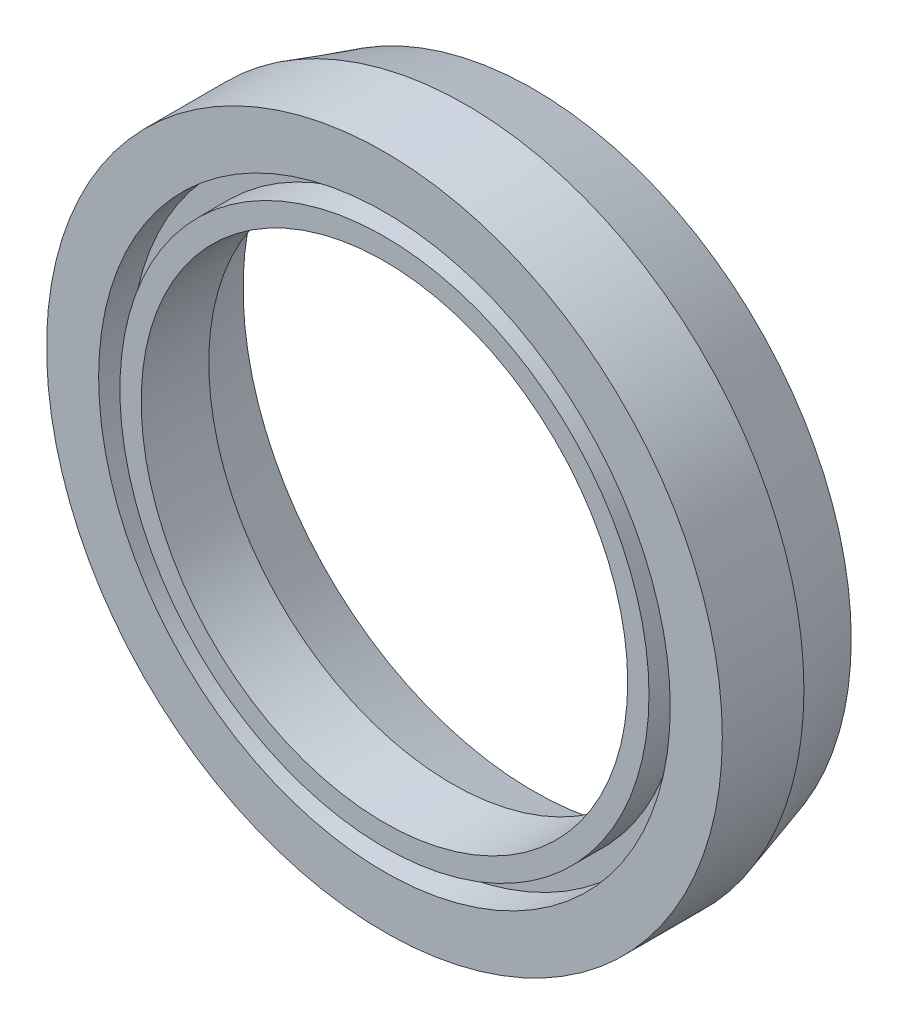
ISO-10303-21;
HEADER;
FILE_DESCRIPTION(('STEP AP214'),'2;1');
FILE_NAME('part.step','',(''),(''),'','','');
FILE_SCHEMA(('AUTOMOTIVE_DESIGN { 1 0 10303 214 1 1 1 1 }'));
ENDSEC;
DATA;
#1=APPLICATION_CONTEXT('core data for automotive mechanical design processes');
#2=APPLICATION_PROTOCOL_DEFINITION('international standard','automotive_design',2000,#1);
#3=PRODUCT_CONTEXT('',#1,'mechanical');
#4=PRODUCT('Part','Part','',(#3));
#5=PRODUCT_RELATED_PRODUCT_CATEGORY('part','',(#4));
#6=PRODUCT_DEFINITION_FORMATION('','',#4);
#7=PRODUCT_DEFINITION_CONTEXT('part definition',#1,'design');
#8=PRODUCT_DEFINITION('design','',#6,#7);
#9=PRODUCT_DEFINITION_SHAPE('','',#8);
#10=(LENGTH_UNIT() NAMED_UNIT(*) SI_UNIT(.MILLI.,.METRE.));
#11=(NAMED_UNIT(*) PLANE_ANGLE_UNIT() SI_UNIT($,.RADIAN.));
#12=(NAMED_UNIT(*) SI_UNIT($,.STERADIAN.) SOLID_ANGLE_UNIT());
#13=UNCERTAINTY_MEASURE_WITH_UNIT(LENGTH_MEASURE(1.E-05),#10,'distance_accuracy_value','');
#14=(GEOMETRIC_REPRESENTATION_CONTEXT(3) GLOBAL_UNCERTAINTY_ASSIGNED_CONTEXT((#13)) GLOBAL_UNIT_ASSIGNED_CONTEXT((#10,
#11,#12)) REPRESENTATION_CONTEXT('',''));
#15=CARTESIAN_POINT('',(0.,0.,0.));
#16=DIRECTION('',(0.,0.,1.));
#17=DIRECTION('',(1.,0.,0.));
#18=AXIS2_PLACEMENT_3D('',#15,#16,#17);
#19=CARTESIAN_POINT('',(0.,0.,3.175));
#20=DIRECTION('',(0.,0.,1.));
#21=DIRECTION('',(1.,0.,0.));
#22=AXIS2_PLACEMENT_3D('',#19,#20,#21);
#23=PLANE('',#22);
#24=CARTESIAN_POINT('',(0.,0.,3.175));
#25=DIRECTION('',(0.,0.,1.));
#26=DIRECTION('',(1.,0.,0.));
#27=AXIS2_PLACEMENT_3D('',#24,#25,#26);
#28=CIRCLE('',#27,11.43);
#29=CARTESIAN_POINT('',(11.43,0.,3.175));
#30=VERTEX_POINT('',#29);
#31=EDGE_CURVE('E39',#30,#30,#28,.T.);
#32=ORIENTED_EDGE('',*,*,#31,.F.);
#33=EDGE_LOOP('',(#32));
#34=FACE_BOUND('',#33,.T.);
#35=CARTESIAN_POINT('',(0.,0.,3.175));
#36=DIRECTION('',(0.,0.,1.));
#37=DIRECTION('',(1.,0.,0.));
#38=AXIS2_PLACEMENT_3D('',#35,#36,#37);
#39=CIRCLE('',#38,12.43);
#40=CARTESIAN_POINT('',(12.43,0.,3.175));
#41=VERTEX_POINT('',#40);
#42=EDGE_CURVE('E73',#41,#41,#39,.T.);
#43=ORIENTED_EDGE('',*,*,#42,.T.);
#44=EDGE_LOOP('',(#43));
#45=FACE_BOUND('',#44,.T.);
#46=ADVANCED_FACE('F28',(#34,#45),#23,.T.);
#47=CARTESIAN_POINT('',(0.,0.,0.));
#48=DIRECTION('',(0.,0.,1.));
#49=DIRECTION('',(1.,0.,0.));
#50=AXIS2_PLACEMENT_3D('',#47,#48,#49);
#51=PLANE('',#50);
#52=CARTESIAN_POINT('',(0.,0.,0.));
#53=DIRECTION('',(0.,0.,1.));
#54=DIRECTION('',(1.,0.,0.));
#55=AXIS2_PLACEMENT_3D('',#52,#53,#54);
#56=CIRCLE('',#55,11.43);
#57=CARTESIAN_POINT('',(11.43,0.,0.));
#58=VERTEX_POINT('',#57);
#59=EDGE_CURVE('E43',#58,#58,#56,.T.);
#60=ORIENTED_EDGE('',*,*,#59,.T.);
#61=EDGE_LOOP('',(#60));
#62=FACE_BOUND('',#61,.T.);
#63=CARTESIAN_POINT('',(0.,0.,0.));
#64=DIRECTION('',(0.,0.,1.));
#65=DIRECTION('',(1.,0.,0.));
#66=AXIS2_PLACEMENT_3D('',#63,#64,#65);
#67=CIRCLE('',#66,12.7);
#68=CARTESIAN_POINT('',(12.7,0.,0.));
#69=VERTEX_POINT('',#68);
#70=EDGE_CURVE('E10',#69,#69,#67,.T.);
#71=ORIENTED_EDGE('',*,*,#70,.F.);
#72=EDGE_LOOP('',(#71));
#73=FACE_BOUND('',#72,.T.);
#74=ADVANCED_FACE('F97',(#62,#73),#51,.F.);
#75=CARTESIAN_POINT('',(0.,0.,3.175));
#76=DIRECTION('',(0.,0.,1.));
#77=DIRECTION('',(1.,0.,0.));
#78=AXIS2_PLACEMENT_3D('',#75,#76,#77);
#79=CIRCLE('',#78,13.43);
#80=CARTESIAN_POINT('',(13.43,0.,3.175));
#81=VERTEX_POINT('',#80);
#82=EDGE_CURVE('E67',#81,#81,#79,.T.);
#83=ORIENTED_EDGE('',*,*,#82,.F.);
#84=EDGE_LOOP('',(#83));
#85=FACE_BOUND('',#84,.T.);
#86=CARTESIAN_POINT('',(0.,0.,3.175));
#87=DIRECTION('',(0.,0.,1.));
#88=DIRECTION('',(1.,0.,0.));
#89=AXIS2_PLACEMENT_3D('',#86,#87,#88);
#90=CIRCLE('',#89,15.875);
#91=CARTESIAN_POINT('',(15.875,0.,3.175));
#92=VERTEX_POINT('',#91);
#93=EDGE_CURVE('E35',#92,#92,#90,.T.);
#94=ORIENTED_EDGE('',*,*,#93,.T.);
#95=EDGE_LOOP('',(#94));
#96=FACE_BOUND('',#95,.T.);
#97=ADVANCED_FACE('F95',(#85,#96),#23,.T.);
#98=CARTESIAN_POINT('',(0.,0.,3.175));
#99=DIRECTION('',(0.,0.,-1.));
#100=DIRECTION('',(-1.,0.,0.));
#101=AXIS2_PLACEMENT_3D('',#98,#99,#100);
#102=CYLINDRICAL_SURFACE('',#101,15.875);
#103=ORIENTED_EDGE('',*,*,#93,.F.);
#104=EDGE_LOOP('',(#103));
#105=FACE_BOUND('',#104,.T.);
#106=CARTESIAN_POINT('',(0.,0.,-0.660399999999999));
#107=DIRECTION('',(0.,0.,1.));
#108=DIRECTION('',(1.,0.,0.));
#109=AXIS2_PLACEMENT_3D('',#106,#107,#108);
#110=CIRCLE('',#109,15.875);
#111=CARTESIAN_POINT('',(15.875,0.,-0.660399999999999));
#112=VERTEX_POINT('',#111);
#113=EDGE_CURVE('E63',#112,#112,#110,.T.);
#114=ORIENTED_EDGE('',*,*,#113,.T.);
#115=EDGE_LOOP('',(#114));
#116=FACE_BOUND('',#115,.T.);
#117=ADVANCED_FACE('F30',(#105,#116),#102,.T.);
#118=CARTESIAN_POINT('',(0.,0.,3.175));
#119=DIRECTION('',(0.,0.,-1.));
#120=DIRECTION('',(-1.,0.,0.));
#121=AXIS2_PLACEMENT_3D('',#118,#119,#120);
#122=CYLINDRICAL_SURFACE('',#121,11.43);
#123=ORIENTED_EDGE('',*,*,#31,.T.);
#124=EDGE_LOOP('',(#123));
#125=FACE_BOUND('',#124,.T.);
#126=ORIENTED_EDGE('',*,*,#59,.F.);
#127=EDGE_LOOP('',(#126));
#128=FACE_BOUND('',#127,.T.);
#129=ADVANCED_FACE('F103',(#125,#128),#122,.F.);
#130=CARTESIAN_POINT('',(0.,0.,3.175));
#131=DIRECTION('',(0.,0.,1.));
#132=DIRECTION('',(1.,0.,0.));
#133=AXIS2_PLACEMENT_3D('',#130,#131,#132);
#134=CYLINDRICAL_SURFACE('',#133,12.7);
#135=CARTESIAN_POINT('',(0.,0.,-0.6604));
#136=DIRECTION('',(0.,0.,1.));
#137=DIRECTION('',(1.,0.,0.));
#138=AXIS2_PLACEMENT_3D('',#135,#136,#137);
#139=CIRCLE('',#138,12.7);
#140=CARTESIAN_POINT('',(12.7,0.,-0.6604));
#141=VERTEX_POINT('',#140);
#142=EDGE_CURVE('E47',#141,#141,#139,.T.);
#143=ORIENTED_EDGE('',*,*,#142,.F.);
#144=EDGE_LOOP('',(#143));
#145=FACE_BOUND('',#144,.T.);
#146=ORIENTED_EDGE('',*,*,#70,.T.);
#147=EDGE_LOOP('',(#146));
#148=FACE_BOUND('',#147,.T.);
#149=ADVANCED_FACE('F137',(#145,#148),#134,.F.);
#150=CARTESIAN_POINT('',(0.,0.,-0.6604));
#151=DIRECTION('',(0.,0.,-1.));
#152=DIRECTION('',(-1.,0.,0.));
#153=AXIS2_PLACEMENT_3D('',#150,#151,#152);
#154=CONICAL_SURFACE('',#153,12.7,0.291456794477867);
#155=CARTESIAN_POINT('',(0.,0.,-3.8354));
#156=DIRECTION('',(0.,0.,1.));
#157=DIRECTION('',(1.,0.,0.));
#158=AXIS2_PLACEMENT_3D('',#155,#156,#157);
#159=CIRCLE('',#158,13.6525);
#160=CARTESIAN_POINT('',(13.6525,0.,-3.8354));
#161=VERTEX_POINT('',#160);
#162=EDGE_CURVE('E51',#161,#161,#159,.T.);
#163=ORIENTED_EDGE('',*,*,#162,.F.);
#164=EDGE_LOOP('',(#163));
#165=FACE_BOUND('',#164,.T.);
#166=ORIENTED_EDGE('',*,*,#142,.T.);
#167=EDGE_LOOP('',(#166));
#168=FACE_BOUND('',#167,.T.);
#169=ADVANCED_FACE('F133',(#165,#168),#154,.F.);
#170=CARTESIAN_POINT('',(0.,0.,3.175));
#171=DIRECTION('',(0.,0.,1.));
#172=DIRECTION('',(1.,0.,0.));
#173=AXIS2_PLACEMENT_3D('',#170,#171,#172);
#174=CYLINDRICAL_SURFACE('',#173,13.6525);
#175=CARTESIAN_POINT('',(0.,0.,-0.0254000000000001));
#176=DIRECTION('',(0.,0.,1.));
#177=DIRECTION('',(1.,0.,0.));
#178=AXIS2_PLACEMENT_3D('',#175,#176,#177);
#179=CIRCLE('',#178,13.6525);
#180=CARTESIAN_POINT('',(13.6525,0.,-0.0254000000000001));
#181=VERTEX_POINT('',#180);
#182=EDGE_CURVE('E54',#181,#181,#179,.T.);
#183=ORIENTED_EDGE('',*,*,#182,.F.);
#184=EDGE_LOOP('',(#183));
#185=FACE_BOUND('',#184,.T.);
#186=ORIENTED_EDGE('',*,*,#162,.T.);
#187=EDGE_LOOP('',(#186));
#188=FACE_BOUND('',#187,.T.);
#189=ADVANCED_FACE('F129',(#185,#188),#174,.T.);
#190=CARTESIAN_POINT('',(-14.9225,0.,-0.0254000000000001));
#191=DIRECTION('',(0.,0.,1.));
#192=DIRECTION('',(1.,0.,0.));
#193=AXIS2_PLACEMENT_3D('',#190,#191,#192);
#194=PLANE('',#193);
#195=CARTESIAN_POINT('',(0.,0.,-0.0254000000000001));
#196=DIRECTION('',(0.,0.,1.));
#197=DIRECTION('',(1.,0.,0.));
#198=AXIS2_PLACEMENT_3D('',#195,#196,#197);
#199=CIRCLE('',#198,14.9225);
#200=CARTESIAN_POINT('',(14.9225,0.,-0.0254000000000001));
#201=VERTEX_POINT('',#200);
#202=EDGE_CURVE('E57',#201,#201,#199,.T.);
#203=ORIENTED_EDGE('',*,*,#202,.F.);
#204=EDGE_LOOP('',(#203));
#205=FACE_BOUND('',#204,.T.);
#206=ORIENTED_EDGE('',*,*,#182,.T.);
#207=EDGE_LOOP('',(#206));
#208=FACE_BOUND('',#207,.T.);
#209=ADVANCED_FACE('F125',(#205,#208),#194,.F.);
#210=CARTESIAN_POINT('',(0.,0.,3.175));
#211=DIRECTION('',(0.,0.,1.));
#212=DIRECTION('',(1.,0.,0.));
#213=AXIS2_PLACEMENT_3D('',#210,#211,#212);
#214=CYLINDRICAL_SURFACE('',#213,14.9225);
#215=CARTESIAN_POINT('',(0.,0.,-3.8354));
#216=DIRECTION('',(0.,0.,1.));
#217=DIRECTION('',(1.,0.,0.));
#218=AXIS2_PLACEMENT_3D('',#215,#216,#217);
#219=CIRCLE('',#218,14.9225);
#220=CARTESIAN_POINT('',(14.9225,0.,-3.8354));
#221=VERTEX_POINT('',#220);
#222=EDGE_CURVE('E60',#221,#221,#219,.T.);
#223=ORIENTED_EDGE('',*,*,#222,.F.);
#224=EDGE_LOOP('',(#223));
#225=FACE_BOUND('',#224,.T.);
#226=ORIENTED_EDGE('',*,*,#202,.T.);
#227=EDGE_LOOP('',(#226));
#228=FACE_BOUND('',#227,.T.);
#229=ADVANCED_FACE('F121',(#225,#228),#214,.F.);
#230=CARTESIAN_POINT('',(0.,0.,-3.8354));
#231=DIRECTION('',(0.,0.,1.));
#232=DIRECTION('',(1.,0.,0.));
#233=AXIS2_PLACEMENT_3D('',#230,#231,#232);
#234=CONICAL_SURFACE('',#233,14.9225,0.291456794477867);
#235=ORIENTED_EDGE('',*,*,#113,.F.);
#236=EDGE_LOOP('',(#235));
#237=FACE_BOUND('',#236,.T.);
#238=ORIENTED_EDGE('',*,*,#222,.T.);
#239=EDGE_LOOP('',(#238));
#240=FACE_BOUND('',#239,.T.);
#241=ADVANCED_FACE('F91',(#237,#240),#234,.T.);
#242=CARTESIAN_POINT('',(0.,0.,1.675));
#243=DIRECTION('',(0.,0.,1.));
#244=DIRECTION('',(1.,0.,0.));
#245=AXIS2_PLACEMENT_3D('',#242,#243,#244);
#246=CYLINDRICAL_SURFACE('',#245,13.43);
#247=CARTESIAN_POINT('',(0.,0.,1.675));
#248=DIRECTION('',(0.,0.,1.));
#249=DIRECTION('',(1.,0.,0.));
#250=AXIS2_PLACEMENT_3D('',#247,#248,#249);
#251=CIRCLE('',#250,13.43);
#252=CARTESIAN_POINT('',(13.43,0.,1.675));
#253=VERTEX_POINT('',#252);
#254=EDGE_CURVE('E66',#253,#253,#251,.T.);
#255=ORIENTED_EDGE('',*,*,#254,.F.);
#256=EDGE_LOOP('',(#255));
#257=FACE_BOUND('',#256,.T.);
#258=ORIENTED_EDGE('',*,*,#82,.T.);
#259=EDGE_LOOP('',(#258));
#260=FACE_BOUND('',#259,.T.);
#261=ADVANCED_FACE('F85',(#257,#260),#246,.F.);
#262=CARTESIAN_POINT('',(0.,0.,1.675));
#263=DIRECTION('',(0.,0.,1.));
#264=DIRECTION('',(1.,0.,0.));
#265=AXIS2_PLACEMENT_3D('',#262,#263,#264);
#266=PLANE('',#265);
#267=CARTESIAN_POINT('',(0.,0.,1.675));
#268=DIRECTION('',(0.,0.,1.));
#269=DIRECTION('',(1.,0.,0.));
#270=AXIS2_PLACEMENT_3D('',#267,#268,#269);
#271=CIRCLE('',#270,12.43);
#272=CARTESIAN_POINT('',(12.43,0.,1.675));
#273=VERTEX_POINT('',#272);
#274=EDGE_CURVE('E70',#273,#273,#271,.T.);
#275=ORIENTED_EDGE('',*,*,#274,.F.);
#276=EDGE_LOOP('',(#275));
#277=FACE_BOUND('',#276,.T.);
#278=ORIENTED_EDGE('',*,*,#254,.T.);
#279=EDGE_LOOP('',(#278));
#280=FACE_BOUND('',#279,.T.);
#281=ADVANCED_FACE('F82',(#277,#280),#266,.T.);
#282=CARTESIAN_POINT('',(0.,0.,1.675));
#283=DIRECTION('',(0.,0.,1.));
#284=DIRECTION('',(1.,0.,0.));
#285=AXIS2_PLACEMENT_3D('',#282,#283,#284);
#286=CYLINDRICAL_SURFACE('',#285,12.43);
#287=ORIENTED_EDGE('',*,*,#274,.T.);
#288=EDGE_LOOP('',(#287));
#289=FACE_BOUND('',#288,.T.);
#290=ORIENTED_EDGE('',*,*,#42,.F.);
#291=EDGE_LOOP('',(#290));
#292=FACE_BOUND('',#291,.T.);
#293=ADVANCED_FACE('F79',(#289,#292),#286,.T.);
#294=CLOSED_SHELL('',(#46,#74,#97,#117,#129,#149,#169,#189,#209,#229,#241,#261,#281,#293));
#295=MANIFOLD_SOLID_BREP('B2',#294);
#296=ADVANCED_BREP_SHAPE_REPRESENTATION('',(#18,#295),#14);
#297=SHAPE_DEFINITION_REPRESENTATION(#9,#296);
ENDSEC;
END-ISO-10303-21;
